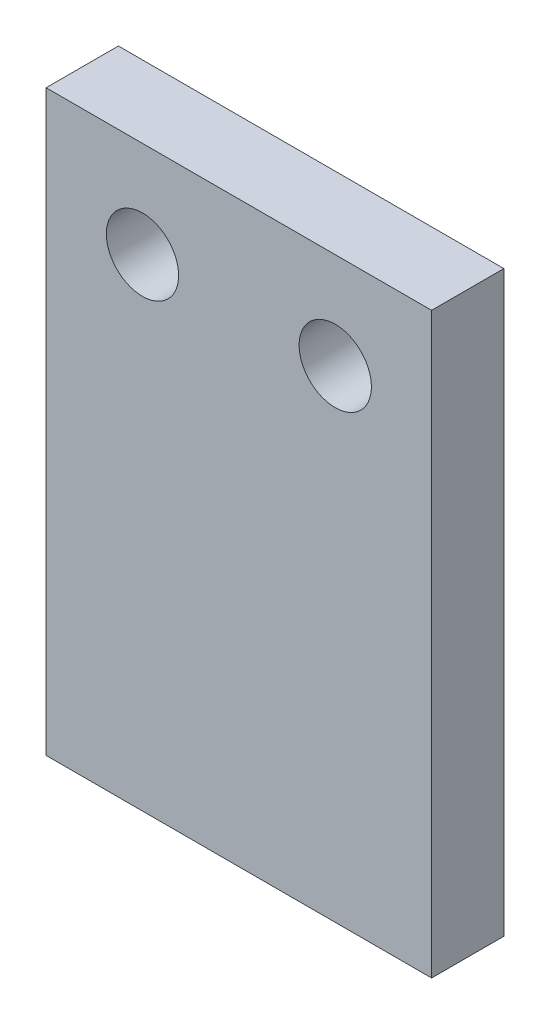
ISO-10303-21;
HEADER;
FILE_DESCRIPTION(('STEP AP214'),'2;1');
FILE_NAME('part.step','',(''),(''),'','','');
FILE_SCHEMA(('AUTOMOTIVE_DESIGN { 1 0 10303 214 1 1 1 1 }'));
ENDSEC;
DATA;
#1=APPLICATION_CONTEXT('core data for automotive mechanical design processes');
#2=APPLICATION_PROTOCOL_DEFINITION('international standard','automotive_design',2000,#1);
#3=PRODUCT_CONTEXT('',#1,'mechanical');
#4=PRODUCT('Part','Part','',(#3));
#5=PRODUCT_RELATED_PRODUCT_CATEGORY('part','',(#4));
#6=PRODUCT_DEFINITION_FORMATION('','',#4);
#7=PRODUCT_DEFINITION_CONTEXT('part definition',#1,'design');
#8=PRODUCT_DEFINITION('design','',#6,#7);
#9=PRODUCT_DEFINITION_SHAPE('','',#8);
#10=(LENGTH_UNIT() NAMED_UNIT(*) SI_UNIT(.MILLI.,.METRE.));
#11=(NAMED_UNIT(*) PLANE_ANGLE_UNIT() SI_UNIT($,.RADIAN.));
#12=(NAMED_UNIT(*) SI_UNIT($,.STERADIAN.) SOLID_ANGLE_UNIT());
#13=UNCERTAINTY_MEASURE_WITH_UNIT(LENGTH_MEASURE(1.E-05),#10,'distance_accuracy_value','');
#14=(GEOMETRIC_REPRESENTATION_CONTEXT(3) GLOBAL_UNCERTAINTY_ASSIGNED_CONTEXT((#13)) GLOBAL_UNIT_ASSIGNED_CONTEXT((#10,
#11,#12)) REPRESENTATION_CONTEXT('',''));
#15=CARTESIAN_POINT('',(0.,0.,0.));
#16=DIRECTION('',(0.,0.,1.));
#17=DIRECTION('',(1.,0.,0.));
#18=AXIS2_PLACEMENT_3D('',#15,#16,#17);
#19=CARTESIAN_POINT('',(-50.8,215.9,19.05));
#20=DIRECTION('',(0.,0.,-1.));
#21=DIRECTION('',(-1.,0.,0.));
#22=AXIS2_PLACEMENT_3D('',#19,#20,#21);
#23=PLANE('',#22);
#24=CARTESIAN_POINT('',(25.4,342.9,19.05));
#25=DIRECTION('',(0.,0.,1.));
#26=DIRECTION('',(1.,0.,0.));
#27=AXIS2_PLACEMENT_3D('',#24,#25,#26);
#28=CIRCLE('',#27,9.525);
#29=CARTESIAN_POINT('',(15.875,342.9,19.05));
#30=VERTEX_POINT('',#29);
#31=EDGE_CURVE('E88',#30,#30,#28,.T.);
#32=ORIENTED_EDGE('',*,*,#31,.F.);
#33=EDGE_LOOP('',(#32));
#34=FACE_BOUND('',#33,.T.);
#35=DIRECTION('',(0.,-1.,0.));
#36=VECTOR('',#35,1.);
#37=CARTESIAN_POINT('',(-50.8000000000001,368.3,19.05));
#38=LINE('',#37,#36);
#39=CARTESIAN_POINT('',(-50.8000000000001,368.3,19.05));
#40=VERTEX_POINT('',#39);
#41=CARTESIAN_POINT('',(-50.8,215.9,19.05));
#42=VERTEX_POINT('',#41);
#43=EDGE_CURVE('E101',#40,#42,#38,.T.);
#44=ORIENTED_EDGE('',*,*,#43,.T.);
#45=DIRECTION('',(-1.,0.,0.));
#46=VECTOR('',#45,1.);
#47=CARTESIAN_POINT('',(50.8,215.9,19.0500000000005));
#48=LINE('',#47,#46);
#49=CARTESIAN_POINT('',(50.8,215.9,19.0500000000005));
#50=VERTEX_POINT('',#49);
#51=EDGE_CURVE('E82',#50,#42,#48,.T.);
#52=ORIENTED_EDGE('',*,*,#51,.F.);
#53=DIRECTION('',(0.,1.,0.));
#54=VECTOR('',#53,1.);
#55=CARTESIAN_POINT('',(50.8,215.9,19.0500000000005));
#56=LINE('',#55,#54);
#57=CARTESIAN_POINT('',(50.8,368.3,19.05));
#58=VERTEX_POINT('',#57);
#59=EDGE_CURVE('E57',#50,#58,#56,.T.);
#60=ORIENTED_EDGE('',*,*,#59,.T.);
#61=DIRECTION('',(1.,0.,0.));
#62=VECTOR('',#61,1.);
#63=CARTESIAN_POINT('',(-50.8000000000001,368.3,19.05));
#64=LINE('',#63,#62);
#65=EDGE_CURVE('E105',#40,#58,#64,.T.);
#66=ORIENTED_EDGE('',*,*,#65,.F.);
#67=EDGE_LOOP('',(#44,#52,#60,#66));
#68=FACE_BOUND('',#67,.T.);
#69=CARTESIAN_POINT('',(-25.4000000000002,342.9,19.05));
#70=DIRECTION('',(0.,0.,1.));
#71=DIRECTION('',(1.,0.,0.));
#72=AXIS2_PLACEMENT_3D('',#69,#70,#71);
#73=CIRCLE('',#72,9.52499999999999);
#74=CARTESIAN_POINT('',(-34.9250000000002,342.9,19.05));
#75=VERTEX_POINT('',#74);
#76=EDGE_CURVE('E141',#75,#75,#73,.T.);
#77=ORIENTED_EDGE('',*,*,#76,.F.);
#78=EDGE_LOOP('',(#77));
#79=FACE_BOUND('',#78,.T.);
#80=ADVANCED_FACE('F34',(#34,#68,#79),#23,.F.);
#81=CARTESIAN_POINT('',(-50.8,215.9,0.));
#82=DIRECTION('',(0.,0.,-1.));
#83=DIRECTION('',(-1.,0.,0.));
#84=AXIS2_PLACEMENT_3D('',#81,#82,#83);
#85=PLANE('',#84);
#86=CARTESIAN_POINT('',(25.4,342.9,0.));
#87=DIRECTION('',(0.,0.,1.));
#88=DIRECTION('',(1.,0.,0.));
#89=AXIS2_PLACEMENT_3D('',#86,#87,#88);
#90=CIRCLE('',#89,9.525);
#91=CARTESIAN_POINT('',(15.875,342.9,0.));
#92=VERTEX_POINT('',#91);
#93=EDGE_CURVE('E146',#92,#92,#90,.T.);
#94=ORIENTED_EDGE('',*,*,#93,.T.);
#95=EDGE_LOOP('',(#94));
#96=FACE_BOUND('',#95,.T.);
#97=DIRECTION('',(0.,-1.,0.));
#98=VECTOR('',#97,1.);
#99=CARTESIAN_POINT('',(-50.8000000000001,368.3,0.));
#100=LINE('',#99,#98);
#101=CARTESIAN_POINT('',(-50.8000000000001,368.3,0.));
#102=VERTEX_POINT('',#101);
#103=CARTESIAN_POINT('',(-50.8,215.9,0.));
#104=VERTEX_POINT('',#103);
#105=EDGE_CURVE('E85',#102,#104,#100,.T.);
#106=ORIENTED_EDGE('',*,*,#105,.F.);
#107=DIRECTION('',(1.,0.,0.));
#108=VECTOR('',#107,1.);
#109=CARTESIAN_POINT('',(-50.8000000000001,368.3,0.));
#110=LINE('',#109,#108);
#111=CARTESIAN_POINT('',(50.8,368.3,0.));
#112=VERTEX_POINT('',#111);
#113=EDGE_CURVE('E96',#102,#112,#110,.T.);
#114=ORIENTED_EDGE('',*,*,#113,.T.);
#115=DIRECTION('',(0.,1.,0.));
#116=VECTOR('',#115,1.);
#117=CARTESIAN_POINT('',(50.8,215.9,5.55111512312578E-13));
#118=LINE('',#117,#116);
#119=CARTESIAN_POINT('',(50.8,215.9,5.55111512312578E-13));
#120=VERTEX_POINT('',#119);
#121=EDGE_CURVE('E94',#120,#112,#118,.T.);
#122=ORIENTED_EDGE('',*,*,#121,.F.);
#123=DIRECTION('',(-1.,0.,0.));
#124=VECTOR('',#123,1.);
#125=CARTESIAN_POINT('',(50.8,215.9,5.55111512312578E-13));
#126=LINE('',#125,#124);
#127=EDGE_CURVE('E81',#120,#104,#126,.T.);
#128=ORIENTED_EDGE('',*,*,#127,.T.);
#129=EDGE_LOOP('',(#106,#114,#122,#128));
#130=FACE_BOUND('',#129,.T.);
#131=CARTESIAN_POINT('',(-25.4000000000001,342.9,0.));
#132=DIRECTION('',(0.,0.,1.));
#133=DIRECTION('',(1.,0.,0.));
#134=AXIS2_PLACEMENT_3D('',#131,#132,#133);
#135=CIRCLE('',#134,9.52499999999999);
#136=CARTESIAN_POINT('',(-34.9250000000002,342.9,0.));
#137=VERTEX_POINT('',#136);
#138=EDGE_CURVE('E144',#137,#137,#135,.T.);
#139=ORIENTED_EDGE('',*,*,#138,.T.);
#140=EDGE_LOOP('',(#139));
#141=FACE_BOUND('',#140,.T.);
#142=ADVANCED_FACE('F91',(#96,#130,#141),#85,.T.);
#143=CARTESIAN_POINT('',(-50.8000000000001,368.3,19.05));
#144=DIRECTION('',(1.,0.,0.));
#145=DIRECTION('',(0.,1.,0.));
#146=AXIS2_PLACEMENT_3D('',#143,#144,#145);
#147=PLANE('',#146);
#148=ORIENTED_EDGE('',*,*,#105,.T.);
#149=DIRECTION('',(0.,0.,-1.));
#150=VECTOR('',#149,1.);
#151=CARTESIAN_POINT('',(-50.8,215.9,19.05));
#152=LINE('',#151,#150);
#153=EDGE_CURVE('E11',#42,#104,#152,.T.);
#154=ORIENTED_EDGE('',*,*,#153,.F.);
#155=ORIENTED_EDGE('',*,*,#43,.F.);
#156=DIRECTION('',(0.,0.,-1.));
#157=VECTOR('',#156,1.);
#158=CARTESIAN_POINT('',(-50.8000000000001,368.3,19.05));
#159=LINE('',#158,#157);
#160=EDGE_CURVE('E49',#40,#102,#159,.T.);
#161=ORIENTED_EDGE('',*,*,#160,.T.);
#162=EDGE_LOOP('',(#148,#154,#155,#161));
#163=FACE_BOUND('',#162,.T.);
#164=ADVANCED_FACE('F36',(#163),#147,.F.);
#165=CARTESIAN_POINT('',(50.8,215.9,19.0500000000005));
#166=DIRECTION('',(0.,-1.,0.));
#167=DIRECTION('',(0.,0.,-1.));
#168=AXIS2_PLACEMENT_3D('',#165,#166,#167);
#169=PLANE('',#168);
#170=ORIENTED_EDGE('',*,*,#127,.F.);
#171=DIRECTION('',(0.,0.,-1.));
#172=VECTOR('',#171,1.);
#173=CARTESIAN_POINT('',(50.8,215.9,19.0500000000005));
#174=LINE('',#173,#172);
#175=EDGE_CURVE('E42',#50,#120,#174,.T.);
#176=ORIENTED_EDGE('',*,*,#175,.F.);
#177=ORIENTED_EDGE('',*,*,#51,.T.);
#178=ORIENTED_EDGE('',*,*,#153,.T.);
#179=EDGE_LOOP('',(#170,#176,#177,#178));
#180=FACE_BOUND('',#179,.T.);
#181=ADVANCED_FACE('F79',(#180),#169,.T.);
#182=CARTESIAN_POINT('',(50.8,215.9,19.0500000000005));
#183=DIRECTION('',(-1.,0.,0.));
#184=DIRECTION('',(0.,-1.,0.));
#185=AXIS2_PLACEMENT_3D('',#182,#183,#184);
#186=PLANE('',#185);
#187=ORIENTED_EDGE('',*,*,#121,.T.);
#188=DIRECTION('',(0.,0.,-1.));
#189=VECTOR('',#188,1.);
#190=CARTESIAN_POINT('',(50.8,368.3,19.05));
#191=LINE('',#190,#189);
#192=EDGE_CURVE('E108',#58,#112,#191,.T.);
#193=ORIENTED_EDGE('',*,*,#192,.F.);
#194=ORIENTED_EDGE('',*,*,#59,.F.);
#195=ORIENTED_EDGE('',*,*,#175,.T.);
#196=EDGE_LOOP('',(#187,#193,#194,#195));
#197=FACE_BOUND('',#196,.T.);
#198=ADVANCED_FACE('F110',(#197),#186,.F.);
#199=CARTESIAN_POINT('',(-50.8000000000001,368.3,19.05));
#200=DIRECTION('',(0.,1.,0.));
#201=DIRECTION('',(0.,0.,1.));
#202=AXIS2_PLACEMENT_3D('',#199,#200,#201);
#203=PLANE('',#202);
#204=ORIENTED_EDGE('',*,*,#113,.F.);
#205=ORIENTED_EDGE('',*,*,#160,.F.);
#206=ORIENTED_EDGE('',*,*,#65,.T.);
#207=ORIENTED_EDGE('',*,*,#192,.T.);
#208=EDGE_LOOP('',(#204,#205,#206,#207));
#209=FACE_BOUND('',#208,.T.);
#210=ADVANCED_FACE('F112',(#209),#203,.T.);
#211=CARTESIAN_POINT('',(25.4,342.9,19.05));
#212=DIRECTION('',(0.,0.,-1.));
#213=DIRECTION('',(-1.,0.,0.));
#214=AXIS2_PLACEMENT_3D('',#211,#212,#213);
#215=CYLINDRICAL_SURFACE('',#214,9.525);
#216=CARTESIAN_POINT('',(15.875,342.9,19.05));
#217=CARTESIAN_POINT('',(15.875,342.9,18.8515625));
#218=CARTESIAN_POINT('',(15.875,342.9,18.653125));
#219=CARTESIAN_POINT('',(15.875,342.9,18.25625));
#220=CARTESIAN_POINT('',(15.875,342.9,18.0578125));
#221=CARTESIAN_POINT('',(15.875,342.9,17.6609375));
#222=CARTESIAN_POINT('',(15.875,342.9,17.4625));
#223=CARTESIAN_POINT('',(15.875,342.9,17.065625));
#224=CARTESIAN_POINT('',(15.875,342.9,16.8671875));
#225=CARTESIAN_POINT('',(15.875,342.9,16.4703125));
#226=CARTESIAN_POINT('',(15.875,342.9,16.271875));
#227=CARTESIAN_POINT('',(15.875,342.9,15.875));
#228=CARTESIAN_POINT('',(15.875,342.9,15.6765625));
#229=CARTESIAN_POINT('',(15.875,342.9,15.2796875));
#230=CARTESIAN_POINT('',(15.875,342.9,15.08125));
#231=CARTESIAN_POINT('',(15.875,342.9,14.684375));
#232=CARTESIAN_POINT('',(15.875,342.9,14.4859375));
#233=CARTESIAN_POINT('',(15.875,342.9,14.0890625));
#234=CARTESIAN_POINT('',(15.875,342.9,13.890625));
#235=CARTESIAN_POINT('',(15.875,342.9,13.49375));
#236=CARTESIAN_POINT('',(15.875,342.9,13.2953125));
#237=CARTESIAN_POINT('',(15.875,342.9,12.8984375));
#238=CARTESIAN_POINT('',(15.875,342.9,12.7));
#239=CARTESIAN_POINT('',(15.875,342.9,12.303125));
#240=CARTESIAN_POINT('',(15.875,342.9,12.1046875));
#241=CARTESIAN_POINT('',(15.875,342.9,11.7078125));
#242=CARTESIAN_POINT('',(15.875,342.9,11.509375));
#243=CARTESIAN_POINT('',(15.875,342.9,11.1125));
#244=CARTESIAN_POINT('',(15.875,342.9,10.9140625));
#245=CARTESIAN_POINT('',(15.875,342.9,10.5171875));
#246=CARTESIAN_POINT('',(15.875,342.9,10.31875));
#247=CARTESIAN_POINT('',(15.875,342.9,9.921875));
#248=CARTESIAN_POINT('',(15.875,342.9,9.7234375));
#249=CARTESIAN_POINT('',(15.875,342.9,9.3265625));
#250=CARTESIAN_POINT('',(15.875,342.9,9.128125));
#251=CARTESIAN_POINT('',(15.875,342.9,8.73125));
#252=CARTESIAN_POINT('',(15.875,342.9,8.5328125));
#253=CARTESIAN_POINT('',(15.875,342.9,8.1359375));
#254=CARTESIAN_POINT('',(15.875,342.9,7.9375));
#255=CARTESIAN_POINT('',(15.875,342.9,7.540625));
#256=CARTESIAN_POINT('',(15.875,342.9,7.3421875));
#257=CARTESIAN_POINT('',(15.875,342.9,6.9453125));
#258=CARTESIAN_POINT('',(15.875,342.9,6.746875));
#259=CARTESIAN_POINT('',(15.875,342.9,6.35));
#260=CARTESIAN_POINT('',(15.875,342.9,6.1515625));
#261=CARTESIAN_POINT('',(15.875,342.9,5.7546875));
#262=CARTESIAN_POINT('',(15.875,342.9,5.55625));
#263=CARTESIAN_POINT('',(15.875,342.9,5.159375));
#264=CARTESIAN_POINT('',(15.875,342.9,4.9609375));
#265=CARTESIAN_POINT('',(15.875,342.9,4.5640625));
#266=CARTESIAN_POINT('',(15.875,342.9,4.365625));
#267=CARTESIAN_POINT('',(15.875,342.9,3.96875));
#268=CARTESIAN_POINT('',(15.875,342.9,3.7703125));
#269=CARTESIAN_POINT('',(15.875,342.9,3.3734375));
#270=CARTESIAN_POINT('',(15.875,342.9,3.175));
#271=CARTESIAN_POINT('',(15.875,342.9,2.778125));
#272=CARTESIAN_POINT('',(15.875,342.9,2.5796875));
#273=CARTESIAN_POINT('',(15.875,342.9,2.1828125));
#274=CARTESIAN_POINT('',(15.875,342.9,1.984375));
#275=CARTESIAN_POINT('',(15.875,342.9,1.5875));
#276=CARTESIAN_POINT('',(15.875,342.9,1.3890625));
#277=CARTESIAN_POINT('',(15.875,342.9,0.992187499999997));
#278=CARTESIAN_POINT('',(15.875,342.9,0.793749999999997));
#279=CARTESIAN_POINT('',(15.875,342.9,0.396874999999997));
#280=CARTESIAN_POINT('',(15.875,342.9,0.198437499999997));
#281=CARTESIAN_POINT('',(15.875,342.9,0.));
#282=B_SPLINE_CURVE_WITH_KNOTS('',3,(#216,#217,#218,#219,#220,#221,#222,#223,#224,#225,#226,
#227,#228,#229,#230,#231,#232,#233,#234,#235,#236,#237,#238,#239,#240,#241,#242,#243,#244,#245,
#246,#247,#248,#249,#250,#251,#252,#253,#254,#255,#256,#257,#258,#259,#260,#261,#262,#263,#264,
#265,#266,#267,#268,#269,#270,#271,#272,#273,#274,#275,#276,#277,#278,#279,#280,#281),
.UNSPECIFIED.,.F.,.F.,(4,2,2,2,2,2,2,2,2,2,2,2,2,2,2,2,2,2,2,2,2,2,2,2,2,2,2,2,2,2,2,2,4),(0.,
0.595312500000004,1.190625,1.7859375,2.38125,2.97656250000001,3.57187500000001,4.16718750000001,
4.76250000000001,5.35781250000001,5.95312500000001,6.54843750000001,7.14375000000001,
7.73906250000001,8.33437500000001,8.92968750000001,9.52500000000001,10.1203125,10.715625,
11.3109375,11.90625,12.5015625,13.096875,13.6921875,14.2875,14.8828125,15.478125,16.0734375,
16.66875,17.2640625,17.859375,18.4546875,19.05),.UNSPECIFIED.);
#283=EDGE_CURVE('BSEAM114',#30,#92,#282,.T.);
#284=ORIENTED_EDGE('',*,*,#31,.T.);
#285=ORIENTED_EDGE('',*,*,#93,.F.);
#286=ORIENTED_EDGE('',*,*,#283,.T.);
#287=ORIENTED_EDGE('',*,*,#283,.F.);
#288=EDGE_LOOP('',(#284,#286,#285,#287));
#289=FACE_BOUND('',#288,.T.);
#290=ADVANCED_FACE('F114',(#289),#215,.F.);
#291=CARTESIAN_POINT('',(-25.4000000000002,342.9,19.05));
#292=DIRECTION('',(0.,0.,-1.));
#293=DIRECTION('',(-1.,0.,0.));
#294=AXIS2_PLACEMENT_3D('',#291,#292,#293);
#295=CYLINDRICAL_SURFACE('',#294,9.52499999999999);
#296=CARTESIAN_POINT('',(-34.9250000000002,342.9,19.05));
#297=CARTESIAN_POINT('',(-34.9250000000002,342.9,18.8515625));
#298=CARTESIAN_POINT('',(-34.9250000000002,342.9,18.653125));
#299=CARTESIAN_POINT('',(-34.9250000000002,342.9,18.25625));
#300=CARTESIAN_POINT('',(-34.9250000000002,342.9,18.0578125));
#301=CARTESIAN_POINT('',(-34.9250000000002,342.9,17.6609375));
#302=CARTESIAN_POINT('',(-34.9250000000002,342.9,17.4625));
#303=CARTESIAN_POINT('',(-34.9250000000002,342.9,17.065625));
#304=CARTESIAN_POINT('',(-34.9250000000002,342.9,16.8671875));
#305=CARTESIAN_POINT('',(-34.9250000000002,342.9,16.4703125));
#306=CARTESIAN_POINT('',(-34.9250000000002,342.9,16.271875));
#307=CARTESIAN_POINT('',(-34.9250000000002,342.9,15.875));
#308=CARTESIAN_POINT('',(-34.9250000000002,342.9,15.6765625));
#309=CARTESIAN_POINT('',(-34.9250000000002,342.9,15.2796875));
#310=CARTESIAN_POINT('',(-34.9250000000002,342.9,15.08125));
#311=CARTESIAN_POINT('',(-34.9250000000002,342.9,14.684375));
#312=CARTESIAN_POINT('',(-34.9250000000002,342.9,14.4859375));
#313=CARTESIAN_POINT('',(-34.9250000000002,342.9,14.0890625));
#314=CARTESIAN_POINT('',(-34.9250000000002,342.9,13.890625));
#315=CARTESIAN_POINT('',(-34.9250000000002,342.9,13.49375));
#316=CARTESIAN_POINT('',(-34.9250000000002,342.9,13.2953125));
#317=CARTESIAN_POINT('',(-34.9250000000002,342.9,12.8984375));
#318=CARTESIAN_POINT('',(-34.9250000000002,342.9,12.7));
#319=CARTESIAN_POINT('',(-34.9250000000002,342.9,12.303125));
#320=CARTESIAN_POINT('',(-34.9250000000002,342.9,12.1046875));
#321=CARTESIAN_POINT('',(-34.9250000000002,342.9,11.7078125));
#322=CARTESIAN_POINT('',(-34.9250000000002,342.9,11.509375));
#323=CARTESIAN_POINT('',(-34.9250000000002,342.9,11.1125));
#324=CARTESIAN_POINT('',(-34.9250000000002,342.9,10.9140625));
#325=CARTESIAN_POINT('',(-34.9250000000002,342.9,10.5171875));
#326=CARTESIAN_POINT('',(-34.9250000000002,342.9,10.31875));
#327=CARTESIAN_POINT('',(-34.9250000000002,342.9,9.921875));
#328=CARTESIAN_POINT('',(-34.9250000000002,342.9,9.7234375));
#329=CARTESIAN_POINT('',(-34.9250000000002,342.9,9.3265625));
#330=CARTESIAN_POINT('',(-34.9250000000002,342.9,9.128125));
#331=CARTESIAN_POINT('',(-34.9250000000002,342.9,8.73125));
#332=CARTESIAN_POINT('',(-34.9250000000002,342.9,8.5328125));
#333=CARTESIAN_POINT('',(-34.9250000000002,342.9,8.1359375));
#334=CARTESIAN_POINT('',(-34.9250000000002,342.9,7.9375));
#335=CARTESIAN_POINT('',(-34.9250000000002,342.9,7.540625));
#336=CARTESIAN_POINT('',(-34.9250000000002,342.9,7.3421875));
#337=CARTESIAN_POINT('',(-34.9250000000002,342.9,6.9453125));
#338=CARTESIAN_POINT('',(-34.9250000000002,342.9,6.746875));
#339=CARTESIAN_POINT('',(-34.9250000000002,342.9,6.35));
#340=CARTESIAN_POINT('',(-34.9250000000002,342.9,6.1515625));
#341=CARTESIAN_POINT('',(-34.9250000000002,342.9,5.7546875));
#342=CARTESIAN_POINT('',(-34.9250000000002,342.9,5.55625));
#343=CARTESIAN_POINT('',(-34.9250000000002,342.9,5.159375));
#344=CARTESIAN_POINT('',(-34.9250000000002,342.9,4.9609375));
#345=CARTESIAN_POINT('',(-34.9250000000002,342.9,4.5640625));
#346=CARTESIAN_POINT('',(-34.9250000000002,342.9,4.365625));
#347=CARTESIAN_POINT('',(-34.9250000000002,342.9,3.96875));
#348=CARTESIAN_POINT('',(-34.9250000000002,342.9,3.7703125));
#349=CARTESIAN_POINT('',(-34.9250000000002,342.9,3.3734375));
#350=CARTESIAN_POINT('',(-34.9250000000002,342.9,3.175));
#351=CARTESIAN_POINT('',(-34.9250000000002,342.9,2.778125));
#352=CARTESIAN_POINT('',(-34.9250000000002,342.9,2.5796875));
#353=CARTESIAN_POINT('',(-34.9250000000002,342.9,2.1828125));
#354=CARTESIAN_POINT('',(-34.9250000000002,342.9,1.984375));
#355=CARTESIAN_POINT('',(-34.9250000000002,342.9,1.5875));
#356=CARTESIAN_POINT('',(-34.9250000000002,342.9,1.3890625));
#357=CARTESIAN_POINT('',(-34.9250000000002,342.9,0.992187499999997));
#358=CARTESIAN_POINT('',(-34.9250000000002,342.9,0.793749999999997));
#359=CARTESIAN_POINT('',(-34.9250000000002,342.9,0.396874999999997));
#360=CARTESIAN_POINT('',(-34.9250000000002,342.9,0.198437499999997));
#361=CARTESIAN_POINT('',(-34.9250000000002,342.9,0.));
#362=B_SPLINE_CURVE_WITH_KNOTS('',3,(#296,#297,#298,#299,#300,#301,#302,#303,#304,#305,#306,
#307,#308,#309,#310,#311,#312,#313,#314,#315,#316,#317,#318,#319,#320,#321,#322,#323,#324,#325,
#326,#327,#328,#329,#330,#331,#332,#333,#334,#335,#336,#337,#338,#339,#340,#341,#342,#343,#344,
#345,#346,#347,#348,#349,#350,#351,#352,#353,#354,#355,#356,#357,#358,#359,#360,#361),
.UNSPECIFIED.,.F.,.F.,(4,2,2,2,2,2,2,2,2,2,2,2,2,2,2,2,2,2,2,2,2,2,2,2,2,2,2,2,2,2,2,2,4),(0.,
0.595312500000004,1.190625,1.7859375,2.38125,2.97656250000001,3.57187500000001,4.16718750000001,
4.76250000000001,5.35781250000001,5.95312500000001,6.54843750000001,7.14375000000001,
7.73906250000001,8.33437500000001,8.92968750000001,9.52500000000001,10.1203125,10.715625,
11.3109375,11.90625,12.5015625,13.096875,13.6921875,14.2875,14.8828125,15.478125,16.0734375,
16.66875,17.2640625,17.859375,18.4546875,19.05),.UNSPECIFIED.);
#363=EDGE_CURVE('BSEAM120',#75,#137,#362,.T.);
#364=ORIENTED_EDGE('',*,*,#76,.T.);
#365=ORIENTED_EDGE('',*,*,#138,.F.);
#366=ORIENTED_EDGE('',*,*,#363,.T.);
#367=ORIENTED_EDGE('',*,*,#363,.F.);
#368=EDGE_LOOP('',(#364,#366,#365,#367));
#369=FACE_BOUND('',#368,.T.);
#370=ADVANCED_FACE('F120',(#369),#295,.F.);
#371=CLOSED_SHELL('',(#80,#142,#164,#181,#198,#210,#290,#370));
#372=MANIFOLD_SOLID_BREP('B2',#371);
#373=ADVANCED_BREP_SHAPE_REPRESENTATION('',(#18,#372),#14);
#374=SHAPE_DEFINITION_REPRESENTATION(#9,#373);
ENDSEC;
END-ISO-10303-21;
